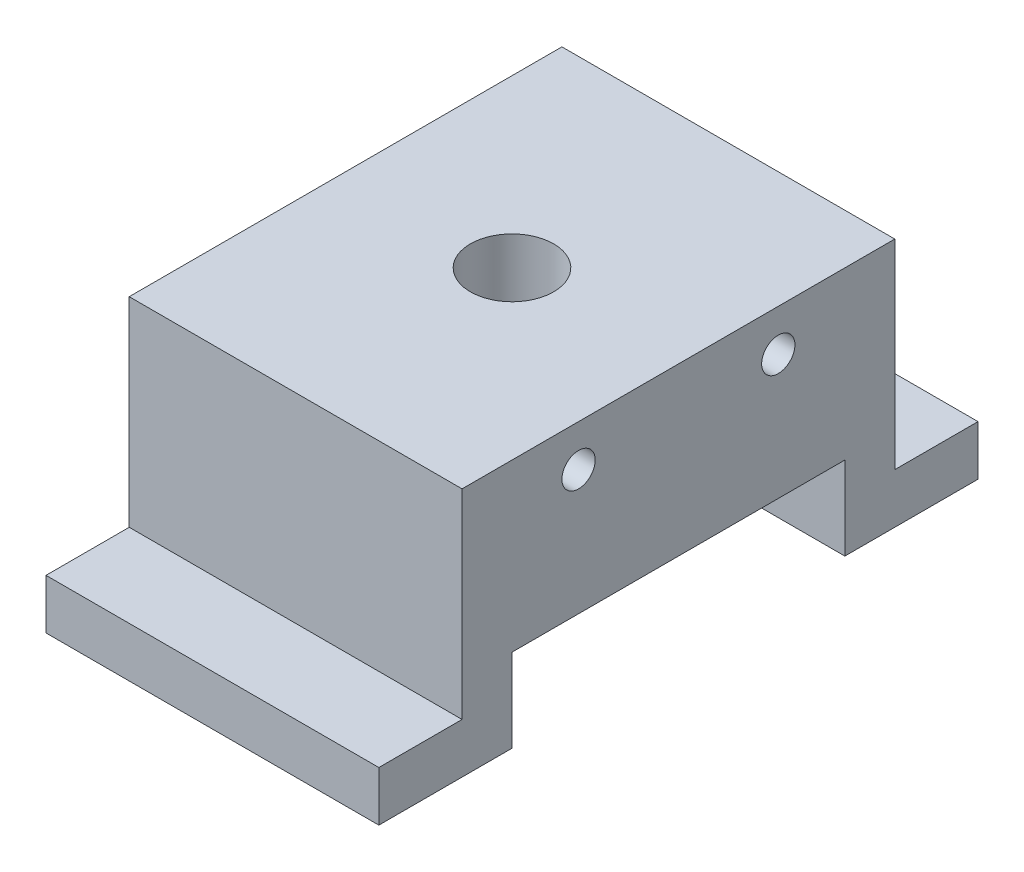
ISO-10303-21;
HEADER;
FILE_DESCRIPTION(('STEP AP214'),'2;1');
FILE_NAME('part.step','',(''),(''),'','','');
FILE_SCHEMA(('AUTOMOTIVE_DESIGN { 1 0 10303 214 1 1 1 1 }'));
ENDSEC;
DATA;
#1=APPLICATION_CONTEXT('core data for automotive mechanical design processes');
#2=APPLICATION_PROTOCOL_DEFINITION('international standard','automotive_design',2000,#1);
#3=PRODUCT_CONTEXT('',#1,'mechanical');
#4=PRODUCT('Part','Part','',(#3));
#5=PRODUCT_RELATED_PRODUCT_CATEGORY('part','',(#4));
#6=PRODUCT_DEFINITION_FORMATION('','',#4);
#7=PRODUCT_DEFINITION_CONTEXT('part definition',#1,'design');
#8=PRODUCT_DEFINITION('design','',#6,#7);
#9=PRODUCT_DEFINITION_SHAPE('','',#8);
#10=(LENGTH_UNIT() NAMED_UNIT(*) SI_UNIT(.MILLI.,.METRE.));
#11=(NAMED_UNIT(*) PLANE_ANGLE_UNIT() SI_UNIT($,.RADIAN.));
#12=(NAMED_UNIT(*) SI_UNIT($,.STERADIAN.) SOLID_ANGLE_UNIT());
#13=UNCERTAINTY_MEASURE_WITH_UNIT(LENGTH_MEASURE(1.E-05),#10,'distance_accuracy_value','');
#14=(GEOMETRIC_REPRESENTATION_CONTEXT(3) GLOBAL_UNCERTAINTY_ASSIGNED_CONTEXT((#13)) GLOBAL_UNIT_ASSIGNED_CONTEXT((#10,
#11,#12)) REPRESENTATION_CONTEXT('',''));
#15=CARTESIAN_POINT('',(0.,0.,0.));
#16=DIRECTION('',(0.,0.,1.));
#17=DIRECTION('',(1.,0.,0.));
#18=AXIS2_PLACEMENT_3D('',#15,#16,#17);
#19=CARTESIAN_POINT('',(10.,0.,0.));
#20=DIRECTION('',(-1.,0.,0.));
#21=DIRECTION('',(0.,0.,1.));
#22=AXIS2_PLACEMENT_3D('',#19,#20,#21);
#23=PLANE('',#22);
#24=DIRECTION('',(0.,1.,0.));
#25=VECTOR('',#24,1.);
#26=CARTESIAN_POINT('',(10.,5.,10.));
#27=LINE('',#26,#25);
#28=CARTESIAN_POINT('',(10.,0.,10.));
#29=VERTEX_POINT('',#28);
#30=CARTESIAN_POINT('',(10.,5.,10.));
#31=VERTEX_POINT('',#30);
#32=EDGE_CURVE('E200',#29,#31,#27,.T.);
#33=ORIENTED_EDGE('',*,*,#32,.T.);
#34=DIRECTION('',(0.,0.,-1.));
#35=VECTOR('',#34,1.);
#36=CARTESIAN_POINT('',(10.,5.,-10.));
#37=LINE('',#36,#35);
#38=CARTESIAN_POINT('',(10.,5.,-10.));
#39=VERTEX_POINT('',#38);
#40=EDGE_CURVE('E112',#31,#39,#37,.T.);
#41=ORIENTED_EDGE('',*,*,#40,.T.);
#42=DIRECTION('',(0.,-1.,0.));
#43=VECTOR('',#42,1.);
#44=CARTESIAN_POINT('',(10.,5.,-10.));
#45=LINE('',#44,#43);
#46=CARTESIAN_POINT('',(10.,0.,-10.));
#47=VERTEX_POINT('',#46);
#48=EDGE_CURVE('E237',#39,#47,#45,.T.);
#49=ORIENTED_EDGE('',*,*,#48,.T.);
#50=DIRECTION('',(0.,0.,-1.));
#51=VECTOR('',#50,1.);
#52=CARTESIAN_POINT('',(10.,0.,-10.));
#53=LINE('',#52,#51);
#54=CARTESIAN_POINT('',(10.,0.,-18.));
#55=VERTEX_POINT('',#54);
#56=EDGE_CURVE('E257',#47,#55,#53,.T.);
#57=ORIENTED_EDGE('',*,*,#56,.T.);
#58=DIRECTION('',(0.,1.,0.));
#59=VECTOR('',#58,1.);
#60=CARTESIAN_POINT('',(10.,0.,-18.));
#61=LINE('',#60,#59);
#62=CARTESIAN_POINT('',(10.,3.,-18.));
#63=VERTEX_POINT('',#62);
#64=EDGE_CURVE('E253',#55,#63,#61,.T.);
#65=ORIENTED_EDGE('',*,*,#64,.T.);
#66=DIRECTION('',(0.,0.,1.));
#67=VECTOR('',#66,1.);
#68=CARTESIAN_POINT('',(10.,3.,-18.));
#69=LINE('',#68,#67);
#70=CARTESIAN_POINT('',(10.,3.,-13.));
#71=VERTEX_POINT('',#70);
#72=EDGE_CURVE('E256',#63,#71,#69,.T.);
#73=ORIENTED_EDGE('',*,*,#72,.T.);
#74=DIRECTION('',(0.,1.,0.));
#75=VECTOR('',#74,1.);
#76=CARTESIAN_POINT('',(10.,3.,-13.));
#77=LINE('',#76,#75);
#78=CARTESIAN_POINT('',(10.,15.,-13.));
#79=VERTEX_POINT('',#78);
#80=EDGE_CURVE('E261',#71,#79,#77,.T.);
#81=ORIENTED_EDGE('',*,*,#80,.T.);
#82=DIRECTION('',(0.,0.,1.));
#83=VECTOR('',#82,1.);
#84=CARTESIAN_POINT('',(10.,15.,13.));
#85=LINE('',#84,#83);
#86=CARTESIAN_POINT('',(10.,15.,13.));
#87=VERTEX_POINT('',#86);
#88=EDGE_CURVE('E268',#79,#87,#85,.T.);
#89=ORIENTED_EDGE('',*,*,#88,.T.);
#90=DIRECTION('',(0.,-1.,0.));
#91=VECTOR('',#90,1.);
#92=CARTESIAN_POINT('',(10.,3.,13.));
#93=LINE('',#92,#91);
#94=CARTESIAN_POINT('',(10.,3.,13.));
#95=VERTEX_POINT('',#94);
#96=EDGE_CURVE('E143',#87,#95,#93,.T.);
#97=ORIENTED_EDGE('',*,*,#96,.T.);
#98=DIRECTION('',(0.,0.,1.));
#99=VECTOR('',#98,1.);
#100=CARTESIAN_POINT('',(10.,3.,18.));
#101=LINE('',#100,#99);
#102=CARTESIAN_POINT('',(10.,3.,18.));
#103=VERTEX_POINT('',#102);
#104=EDGE_CURVE('E137',#95,#103,#101,.T.);
#105=ORIENTED_EDGE('',*,*,#104,.T.);
#106=DIRECTION('',(0.,-1.,0.));
#107=VECTOR('',#106,1.);
#108=CARTESIAN_POINT('',(10.,0.,18.));
#109=LINE('',#108,#107);
#110=CARTESIAN_POINT('',(10.,0.,18.));
#111=VERTEX_POINT('',#110);
#112=EDGE_CURVE('E141',#103,#111,#109,.T.);
#113=ORIENTED_EDGE('',*,*,#112,.T.);
#114=DIRECTION('',(0.,0.,-1.));
#115=VECTOR('',#114,1.);
#116=CARTESIAN_POINT('',(10.,0.,10.));
#117=LINE('',#116,#115);
#118=EDGE_CURVE('E57',#111,#29,#117,.T.);
#119=ORIENTED_EDGE('',*,*,#118,.T.);
#120=EDGE_LOOP('',(#33,#41,#49,#57,#65,#73,#81,#89,#97,#105,#113,#119));
#121=FACE_BOUND('',#120,.T.);
#122=CARTESIAN_POINT('',(10.,12.5,6.));
#123=DIRECTION('',(1.,0.,0.));
#124=DIRECTION('',(0.,0.,-1.));
#125=AXIS2_PLACEMENT_3D('',#122,#123,#124);
#126=CIRCLE('',#125,1.);
#127=CARTESIAN_POINT('',(10.,12.5,5.));
#128=VERTEX_POINT('',#127);
#129=EDGE_CURVE('E170',#128,#128,#126,.T.);
#130=ORIENTED_EDGE('',*,*,#129,.F.);
#131=EDGE_LOOP('',(#130));
#132=FACE_BOUND('',#131,.T.);
#133=CARTESIAN_POINT('',(10.,12.5,-6.));
#134=DIRECTION('',(1.,0.,0.));
#135=DIRECTION('',(0.,0.,-1.));
#136=AXIS2_PLACEMENT_3D('',#133,#134,#135);
#137=CIRCLE('',#136,1.);
#138=CARTESIAN_POINT('',(10.,12.5,-7.));
#139=VERTEX_POINT('',#138);
#140=EDGE_CURVE('E341',#139,#139,#137,.T.);
#141=ORIENTED_EDGE('',*,*,#140,.F.);
#142=EDGE_LOOP('',(#141));
#143=FACE_BOUND('',#142,.T.);
#144=ADVANCED_FACE('F39',(#121,#132,#143),#23,.F.);
#145=CARTESIAN_POINT('',(-10.,0.,0.));
#146=DIRECTION('',(-1.,0.,0.));
#147=DIRECTION('',(0.,0.,1.));
#148=AXIS2_PLACEMENT_3D('',#145,#146,#147);
#149=PLANE('',#148);
#150=CARTESIAN_POINT('',(-10.,12.5,6.));
#151=DIRECTION('',(1.,0.,0.));
#152=DIRECTION('',(0.,0.,-1.));
#153=AXIS2_PLACEMENT_3D('',#150,#151,#152);
#154=CIRCLE('',#153,1.);
#155=CARTESIAN_POINT('',(-10.,12.5,5.));
#156=VERTEX_POINT('',#155);
#157=EDGE_CURVE('E345',#156,#156,#154,.T.);
#158=ORIENTED_EDGE('',*,*,#157,.T.);
#159=EDGE_LOOP('',(#158));
#160=FACE_BOUND('',#159,.T.);
#161=DIRECTION('',(0.,1.,0.));
#162=VECTOR('',#161,1.);
#163=CARTESIAN_POINT('',(-10.,5.,10.));
#164=LINE('',#163,#162);
#165=CARTESIAN_POINT('',(-10.,0.,10.));
#166=VERTEX_POINT('',#165);
#167=CARTESIAN_POINT('',(-10.,5.,10.));
#168=VERTEX_POINT('',#167);
#169=EDGE_CURVE('E165',#166,#168,#164,.T.);
#170=ORIENTED_EDGE('',*,*,#169,.F.);
#171=DIRECTION('',(0.,0.,-1.));
#172=VECTOR('',#171,1.);
#173=CARTESIAN_POINT('',(-10.,0.,10.));
#174=LINE('',#173,#172);
#175=CARTESIAN_POINT('',(-10.,0.,18.));
#176=VERTEX_POINT('',#175);
#177=EDGE_CURVE('E104',#176,#166,#174,.T.);
#178=ORIENTED_EDGE('',*,*,#177,.F.);
#179=DIRECTION('',(0.,-1.,0.));
#180=VECTOR('',#179,1.);
#181=CARTESIAN_POINT('',(-10.,0.,18.));
#182=LINE('',#181,#180);
#183=CARTESIAN_POINT('',(-10.,3.,18.));
#184=VERTEX_POINT('',#183);
#185=EDGE_CURVE('E98',#184,#176,#182,.T.);
#186=ORIENTED_EDGE('',*,*,#185,.F.);
#187=DIRECTION('',(0.,0.,1.));
#188=VECTOR('',#187,1.);
#189=CARTESIAN_POINT('',(-10.,3.,18.));
#190=LINE('',#189,#188);
#191=CARTESIAN_POINT('',(-10.,3.,13.));
#192=VERTEX_POINT('',#191);
#193=EDGE_CURVE('E152',#192,#184,#190,.T.);
#194=ORIENTED_EDGE('',*,*,#193,.F.);
#195=DIRECTION('',(0.,-1.,0.));
#196=VECTOR('',#195,1.);
#197=CARTESIAN_POINT('',(-10.,3.,13.));
#198=LINE('',#197,#196);
#199=CARTESIAN_POINT('',(-10.,15.,13.));
#200=VERTEX_POINT('',#199);
#201=EDGE_CURVE('E191',#200,#192,#198,.T.);
#202=ORIENTED_EDGE('',*,*,#201,.F.);
#203=DIRECTION('',(0.,0.,1.));
#204=VECTOR('',#203,1.);
#205=CARTESIAN_POINT('',(-10.,15.,13.));
#206=LINE('',#205,#204);
#207=CARTESIAN_POINT('',(-10.,15.,-13.));
#208=VERTEX_POINT('',#207);
#209=EDGE_CURVE('E188',#208,#200,#206,.T.);
#210=ORIENTED_EDGE('',*,*,#209,.F.);
#211=DIRECTION('',(0.,1.,0.));
#212=VECTOR('',#211,1.);
#213=CARTESIAN_POINT('',(-10.,3.,-13.));
#214=LINE('',#213,#212);
#215=CARTESIAN_POINT('',(-10.,3.,-13.));
#216=VERTEX_POINT('',#215);
#217=EDGE_CURVE('E185',#216,#208,#214,.T.);
#218=ORIENTED_EDGE('',*,*,#217,.F.);
#219=DIRECTION('',(0.,0.,1.));
#220=VECTOR('',#219,1.);
#221=CARTESIAN_POINT('',(-10.,3.,-18.));
#222=LINE('',#221,#220);
#223=CARTESIAN_POINT('',(-10.,3.,-18.));
#224=VERTEX_POINT('',#223);
#225=EDGE_CURVE('E182',#224,#216,#222,.T.);
#226=ORIENTED_EDGE('',*,*,#225,.F.);
#227=DIRECTION('',(0.,1.,0.));
#228=VECTOR('',#227,1.);
#229=CARTESIAN_POINT('',(-10.,0.,-18.));
#230=LINE('',#229,#228);
#231=CARTESIAN_POINT('',(-10.,0.,-18.));
#232=VERTEX_POINT('',#231);
#233=EDGE_CURVE('E179',#232,#224,#230,.T.);
#234=ORIENTED_EDGE('',*,*,#233,.F.);
#235=DIRECTION('',(0.,0.,-1.));
#236=VECTOR('',#235,1.);
#237=CARTESIAN_POINT('',(-10.,0.,-10.));
#238=LINE('',#237,#236);
#239=CARTESIAN_POINT('',(-10.,0.,-10.));
#240=VERTEX_POINT('',#239);
#241=EDGE_CURVE('E176',#240,#232,#238,.T.);
#242=ORIENTED_EDGE('',*,*,#241,.F.);
#243=DIRECTION('',(0.,-1.,0.));
#244=VECTOR('',#243,1.);
#245=CARTESIAN_POINT('',(-10.,5.,-10.));
#246=LINE('',#245,#244);
#247=CARTESIAN_POINT('',(-10.,5.,-10.));
#248=VERTEX_POINT('',#247);
#249=EDGE_CURVE('E173',#248,#240,#246,.T.);
#250=ORIENTED_EDGE('',*,*,#249,.F.);
#251=DIRECTION('',(0.,0.,-1.));
#252=VECTOR('',#251,1.);
#253=CARTESIAN_POINT('',(-10.,5.,-10.));
#254=LINE('',#253,#252);
#255=EDGE_CURVE('E169',#168,#248,#254,.T.);
#256=ORIENTED_EDGE('',*,*,#255,.F.);
#257=EDGE_LOOP('',(#170,#178,#186,#194,#202,#210,#218,#226,#234,#242,#250,#256));
#258=FACE_BOUND('',#257,.T.);
#259=CARTESIAN_POINT('',(-10.,12.5,-6.));
#260=DIRECTION('',(1.,0.,0.));
#261=DIRECTION('',(0.,0.,-1.));
#262=AXIS2_PLACEMENT_3D('',#259,#260,#261);
#263=CIRCLE('',#262,1.);
#264=CARTESIAN_POINT('',(-10.,12.5,-7.));
#265=VERTEX_POINT('',#264);
#266=EDGE_CURVE('E337',#265,#265,#263,.T.);
#267=ORIENTED_EDGE('',*,*,#266,.T.);
#268=EDGE_LOOP('',(#267));
#269=FACE_BOUND('',#268,.T.);
#270=ADVANCED_FACE('F241',(#160,#258,#269),#149,.T.);
#271=CARTESIAN_POINT('',(10.,5.,10.));
#272=DIRECTION('',(0.,0.,1.));
#273=DIRECTION('',(1.,0.,0.));
#274=AXIS2_PLACEMENT_3D('',#271,#272,#273);
#275=PLANE('',#274);
#276=ORIENTED_EDGE('',*,*,#169,.T.);
#277=DIRECTION('',(-1.,0.,0.));
#278=VECTOR('',#277,1.);
#279=CARTESIAN_POINT('',(10.,5.,10.));
#280=LINE('',#279,#278);
#281=EDGE_CURVE('E11',#31,#168,#280,.T.);
#282=ORIENTED_EDGE('',*,*,#281,.F.);
#283=ORIENTED_EDGE('',*,*,#32,.F.);
#284=DIRECTION('',(-1.,0.,0.));
#285=VECTOR('',#284,1.);
#286=CARTESIAN_POINT('',(10.,0.,10.));
#287=LINE('',#286,#285);
#288=EDGE_CURVE('E161',#29,#166,#287,.T.);
#289=ORIENTED_EDGE('',*,*,#288,.T.);
#290=EDGE_LOOP('',(#276,#282,#283,#289));
#291=FACE_BOUND('',#290,.T.);
#292=ADVANCED_FACE('F41',(#291),#275,.F.);
#293=CARTESIAN_POINT('',(10.,5.,-10.));
#294=DIRECTION('',(0.,1.,0.));
#295=DIRECTION('',(0.,0.,1.));
#296=AXIS2_PLACEMENT_3D('',#293,#294,#295);
#297=PLANE('',#296);
#298=CARTESIAN_POINT('',(0.,5.,0.));
#299=DIRECTION('',(0.,-1.,0.));
#300=DIRECTION('',(0.,0.,-1.));
#301=AXIS2_PLACEMENT_3D('',#298,#299,#300);
#302=CIRCLE('',#301,7.);
#303=CARTESIAN_POINT('',(0.,5.,-7.));
#304=VERTEX_POINT('',#303);
#305=EDGE_CURVE('E330',#304,#304,#302,.T.);
#306=ORIENTED_EDGE('',*,*,#305,.F.);
#307=EDGE_LOOP('',(#306));
#308=FACE_BOUND('',#307,.T.);
#309=ORIENTED_EDGE('',*,*,#255,.T.);
#310=DIRECTION('',(-1.,0.,0.));
#311=VECTOR('',#310,1.);
#312=CARTESIAN_POINT('',(10.,5.,-10.));
#313=LINE('',#312,#311);
#314=EDGE_CURVE('E49',#39,#248,#313,.T.);
#315=ORIENTED_EDGE('',*,*,#314,.F.);
#316=ORIENTED_EDGE('',*,*,#40,.F.);
#317=ORIENTED_EDGE('',*,*,#281,.T.);
#318=EDGE_LOOP('',(#309,#315,#316,#317));
#319=FACE_BOUND('',#318,.T.);
#320=ADVANCED_FACE('F369',(#308,#319),#297,.F.);
#321=CARTESIAN_POINT('',(10.,5.,-10.));
#322=DIRECTION('',(0.,0.,-1.));
#323=DIRECTION('',(-1.,0.,0.));
#324=AXIS2_PLACEMENT_3D('',#321,#322,#323);
#325=PLANE('',#324);
#326=ORIENTED_EDGE('',*,*,#249,.T.);
#327=DIRECTION('',(-1.,0.,0.));
#328=VECTOR('',#327,1.);
#329=CARTESIAN_POINT('',(10.,0.,-10.));
#330=LINE('',#329,#328);
#331=EDGE_CURVE('E227',#47,#240,#330,.T.);
#332=ORIENTED_EDGE('',*,*,#331,.F.);
#333=ORIENTED_EDGE('',*,*,#48,.F.);
#334=ORIENTED_EDGE('',*,*,#314,.T.);
#335=EDGE_LOOP('',(#326,#332,#333,#334));
#336=FACE_BOUND('',#335,.T.);
#337=ADVANCED_FACE('F235',(#336),#325,.F.);
#338=CARTESIAN_POINT('',(10.,0.,-10.));
#339=DIRECTION('',(0.,1.,0.));
#340=DIRECTION('',(0.,0.,1.));
#341=AXIS2_PLACEMENT_3D('',#338,#339,#340);
#342=PLANE('',#341);
#343=ORIENTED_EDGE('',*,*,#241,.T.);
#344=DIRECTION('',(-1.,0.,0.));
#345=VECTOR('',#344,1.);
#346=CARTESIAN_POINT('',(10.,0.,-18.));
#347=LINE('',#346,#345);
#348=EDGE_CURVE('E223',#55,#232,#347,.T.);
#349=ORIENTED_EDGE('',*,*,#348,.F.);
#350=ORIENTED_EDGE('',*,*,#56,.F.);
#351=ORIENTED_EDGE('',*,*,#331,.T.);
#352=EDGE_LOOP('',(#343,#349,#350,#351));
#353=FACE_BOUND('',#352,.T.);
#354=ADVANCED_FACE('F247',(#353),#342,.F.);
#355=CARTESIAN_POINT('',(10.,0.,-18.));
#356=DIRECTION('',(0.,0.,1.));
#357=DIRECTION('',(1.,0.,0.));
#358=AXIS2_PLACEMENT_3D('',#355,#356,#357);
#359=PLANE('',#358);
#360=ORIENTED_EDGE('',*,*,#233,.T.);
#361=DIRECTION('',(-1.,0.,0.));
#362=VECTOR('',#361,1.);
#363=CARTESIAN_POINT('',(10.,3.,-18.));
#364=LINE('',#363,#362);
#365=EDGE_CURVE('E219',#63,#224,#364,.T.);
#366=ORIENTED_EDGE('',*,*,#365,.F.);
#367=ORIENTED_EDGE('',*,*,#64,.F.);
#368=ORIENTED_EDGE('',*,*,#348,.T.);
#369=EDGE_LOOP('',(#360,#366,#367,#368));
#370=FACE_BOUND('',#369,.T.);
#371=ADVANCED_FACE('F251',(#370),#359,.F.);
#372=CARTESIAN_POINT('',(10.,3.,-18.));
#373=DIRECTION('',(0.,-1.,0.));
#374=DIRECTION('',(0.,0.,-1.));
#375=AXIS2_PLACEMENT_3D('',#372,#373,#374);
#376=PLANE('',#375);
#377=ORIENTED_EDGE('',*,*,#225,.T.);
#378=DIRECTION('',(-1.,0.,0.));
#379=VECTOR('',#378,1.);
#380=CARTESIAN_POINT('',(10.,3.,-13.));
#381=LINE('',#380,#379);
#382=EDGE_CURVE('E215',#71,#216,#381,.T.);
#383=ORIENTED_EDGE('',*,*,#382,.F.);
#384=ORIENTED_EDGE('',*,*,#72,.F.);
#385=ORIENTED_EDGE('',*,*,#365,.T.);
#386=EDGE_LOOP('',(#377,#383,#384,#385));
#387=FACE_BOUND('',#386,.T.);
#388=ADVANCED_FACE('F381',(#387),#376,.F.);
#389=CARTESIAN_POINT('',(10.,3.,-13.));
#390=DIRECTION('',(0.,0.,1.));
#391=DIRECTION('',(1.,0.,0.));
#392=AXIS2_PLACEMENT_3D('',#389,#390,#391);
#393=PLANE('',#392);
#394=ORIENTED_EDGE('',*,*,#217,.T.);
#395=DIRECTION('',(-1.,0.,0.));
#396=VECTOR('',#395,1.);
#397=CARTESIAN_POINT('',(10.,15.,-13.));
#398=LINE('',#397,#396);
#399=EDGE_CURVE('E211',#79,#208,#398,.T.);
#400=ORIENTED_EDGE('',*,*,#399,.F.);
#401=ORIENTED_EDGE('',*,*,#80,.F.);
#402=ORIENTED_EDGE('',*,*,#382,.T.);
#403=EDGE_LOOP('',(#394,#400,#401,#402));
#404=FACE_BOUND('',#403,.T.);
#405=ADVANCED_FACE('F384',(#404),#393,.F.);
#406=CARTESIAN_POINT('',(10.,15.,13.));
#407=DIRECTION('',(0.,-1.,0.));
#408=DIRECTION('',(0.,0.,-1.));
#409=AXIS2_PLACEMENT_3D('',#406,#407,#408);
#410=PLANE('',#409);
#411=CARTESIAN_POINT('',(0.,15.,0.));
#412=DIRECTION('',(0.,-1.,0.));
#413=DIRECTION('',(0.,0.,-1.));
#414=AXIS2_PLACEMENT_3D('',#411,#412,#413);
#415=CIRCLE('',#414,2.5);
#416=CARTESIAN_POINT('',(0.,15.,-2.5));
#417=VERTEX_POINT('',#416);
#418=EDGE_CURVE('E323',#417,#417,#415,.T.);
#419=ORIENTED_EDGE('',*,*,#418,.T.);
#420=EDGE_LOOP('',(#419));
#421=FACE_BOUND('',#420,.T.);
#422=ORIENTED_EDGE('',*,*,#209,.T.);
#423=DIRECTION('',(-1.,0.,0.));
#424=VECTOR('',#423,1.);
#425=CARTESIAN_POINT('',(10.,15.,13.));
#426=LINE('',#425,#424);
#427=EDGE_CURVE('E207',#87,#200,#426,.T.);
#428=ORIENTED_EDGE('',*,*,#427,.F.);
#429=ORIENTED_EDGE('',*,*,#88,.F.);
#430=ORIENTED_EDGE('',*,*,#399,.T.);
#431=EDGE_LOOP('',(#422,#428,#429,#430));
#432=FACE_BOUND('',#431,.T.);
#433=ADVANCED_FACE('F276',(#421,#432),#410,.F.);
#434=CARTESIAN_POINT('',(10.,3.,13.));
#435=DIRECTION('',(0.,0.,-1.));
#436=DIRECTION('',(-1.,0.,0.));
#437=AXIS2_PLACEMENT_3D('',#434,#435,#436);
#438=PLANE('',#437);
#439=ORIENTED_EDGE('',*,*,#201,.T.);
#440=DIRECTION('',(-1.,0.,0.));
#441=VECTOR('',#440,1.);
#442=CARTESIAN_POINT('',(10.,3.,13.));
#443=LINE('',#442,#441);
#444=EDGE_CURVE('E154',#95,#192,#443,.T.);
#445=ORIENTED_EDGE('',*,*,#444,.F.);
#446=ORIENTED_EDGE('',*,*,#96,.F.);
#447=ORIENTED_EDGE('',*,*,#427,.T.);
#448=EDGE_LOOP('',(#439,#445,#446,#447));
#449=FACE_BOUND('',#448,.T.);
#450=ADVANCED_FACE('F280',(#449),#438,.F.);
#451=CARTESIAN_POINT('',(10.,3.,18.));
#452=DIRECTION('',(0.,-1.,0.));
#453=DIRECTION('',(0.,0.,-1.));
#454=AXIS2_PLACEMENT_3D('',#451,#452,#453);
#455=PLANE('',#454);
#456=ORIENTED_EDGE('',*,*,#193,.T.);
#457=DIRECTION('',(-1.,0.,0.));
#458=VECTOR('',#457,1.);
#459=CARTESIAN_POINT('',(10.,3.,18.));
#460=LINE('',#459,#458);
#461=EDGE_CURVE('E149',#103,#184,#460,.T.);
#462=ORIENTED_EDGE('',*,*,#461,.F.);
#463=ORIENTED_EDGE('',*,*,#104,.F.);
#464=ORIENTED_EDGE('',*,*,#444,.T.);
#465=EDGE_LOOP('',(#456,#462,#463,#464));
#466=FACE_BOUND('',#465,.T.);
#467=ADVANCED_FACE('F150',(#466),#455,.F.);
#468=CARTESIAN_POINT('',(10.,0.,18.));
#469=DIRECTION('',(0.,0.,-1.));
#470=DIRECTION('',(-1.,0.,0.));
#471=AXIS2_PLACEMENT_3D('',#468,#469,#470);
#472=PLANE('',#471);
#473=ORIENTED_EDGE('',*,*,#185,.T.);
#474=DIRECTION('',(-1.,0.,0.));
#475=VECTOR('',#474,1.);
#476=CARTESIAN_POINT('',(10.,0.,18.));
#477=LINE('',#476,#475);
#478=EDGE_CURVE('E155',#111,#176,#477,.T.);
#479=ORIENTED_EDGE('',*,*,#478,.F.);
#480=ORIENTED_EDGE('',*,*,#112,.F.);
#481=ORIENTED_EDGE('',*,*,#461,.T.);
#482=EDGE_LOOP('',(#473,#479,#480,#481));
#483=FACE_BOUND('',#482,.T.);
#484=ADVANCED_FACE('F157',(#483),#472,.F.);
#485=CARTESIAN_POINT('',(10.,0.,10.));
#486=DIRECTION('',(0.,1.,0.));
#487=DIRECTION('',(0.,0.,1.));
#488=AXIS2_PLACEMENT_3D('',#485,#486,#487);
#489=PLANE('',#488);
#490=ORIENTED_EDGE('',*,*,#177,.T.);
#491=ORIENTED_EDGE('',*,*,#288,.F.);
#492=ORIENTED_EDGE('',*,*,#118,.F.);
#493=ORIENTED_EDGE('',*,*,#478,.T.);
#494=EDGE_LOOP('',(#490,#491,#492,#493));
#495=FACE_BOUND('',#494,.T.);
#496=ADVANCED_FACE('F284',(#495),#489,.F.);
#497=CARTESIAN_POINT('',(10.,12.5,6.));
#498=DIRECTION('',(-1.,0.,0.));
#499=DIRECTION('',(0.,0.,1.));
#500=AXIS2_PLACEMENT_3D('',#497,#498,#499);
#501=CYLINDRICAL_SURFACE('',#500,1.);
#502=ORIENTED_EDGE('',*,*,#129,.T.);
#503=EDGE_LOOP('',(#502));
#504=FACE_BOUND('',#503,.T.);
#505=ORIENTED_EDGE('',*,*,#157,.F.);
#506=EDGE_LOOP('',(#505));
#507=FACE_BOUND('',#506,.T.);
#508=ADVANCED_FACE('F286',(#504,#507),#501,.F.);
#509=CARTESIAN_POINT('',(10.,12.5,-6.));
#510=DIRECTION('',(-1.,0.,0.));
#511=DIRECTION('',(0.,0.,1.));
#512=AXIS2_PLACEMENT_3D('',#509,#510,#511);
#513=CYLINDRICAL_SURFACE('',#512,1.);
#514=ORIENTED_EDGE('',*,*,#140,.T.);
#515=EDGE_LOOP('',(#514));
#516=FACE_BOUND('',#515,.T.);
#517=ORIENTED_EDGE('',*,*,#266,.F.);
#518=EDGE_LOOP('',(#517));
#519=FACE_BOUND('',#518,.T.);
#520=ADVANCED_FACE('F292',(#516,#519),#513,.F.);
#521=CARTESIAN_POINT('',(0.,10.,0.));
#522=DIRECTION('',(0.,-1.,0.));
#523=DIRECTION('',(0.,0.,-1.));
#524=AXIS2_PLACEMENT_3D('',#521,#522,#523);
#525=CYLINDRICAL_SURFACE('',#524,7.);
#526=CARTESIAN_POINT('',(0.,10.,0.));
#527=DIRECTION('',(0.,-1.,0.));
#528=DIRECTION('',(0.,0.,-1.));
#529=AXIS2_PLACEMENT_3D('',#526,#527,#528);
#530=CIRCLE('',#529,7.);
#531=CARTESIAN_POINT('',(0.,10.,-7.));
#532=VERTEX_POINT('',#531);
#533=EDGE_CURVE('E333',#532,#532,#530,.T.);
#534=ORIENTED_EDGE('',*,*,#533,.F.);
#535=EDGE_LOOP('',(#534));
#536=FACE_BOUND('',#535,.T.);
#537=ORIENTED_EDGE('',*,*,#305,.T.);
#538=EDGE_LOOP('',(#537));
#539=FACE_BOUND('',#538,.T.);
#540=ADVANCED_FACE('F306',(#536,#539),#525,.F.);
#541=CARTESIAN_POINT('',(0.,10.,0.));
#542=DIRECTION('',(0.,-1.,0.));
#543=DIRECTION('',(0.,0.,-1.));
#544=AXIS2_PLACEMENT_3D('',#541,#542,#543);
#545=PLANE('',#544);
#546=CARTESIAN_POINT('',(0.,10.,0.));
#547=DIRECTION('',(0.,-1.,0.));
#548=DIRECTION('',(0.,0.,-1.));
#549=AXIS2_PLACEMENT_3D('',#546,#547,#548);
#550=CIRCLE('',#549,2.5);
#551=CARTESIAN_POINT('',(0.,10.,-2.5));
#552=VERTEX_POINT('',#551);
#553=EDGE_CURVE('E326',#552,#552,#550,.T.);
#554=ORIENTED_EDGE('',*,*,#553,.F.);
#555=EDGE_LOOP('',(#554));
#556=FACE_BOUND('',#555,.T.);
#557=ORIENTED_EDGE('',*,*,#533,.T.);
#558=EDGE_LOOP('',(#557));
#559=FACE_BOUND('',#558,.T.);
#560=ADVANCED_FACE('F310',(#556,#559),#545,.T.);
#561=CARTESIAN_POINT('',(0.,15.,0.));
#562=DIRECTION('',(0.,-1.,0.));
#563=DIRECTION('',(0.,0.,-1.));
#564=AXIS2_PLACEMENT_3D('',#561,#562,#563);
#565=CYLINDRICAL_SURFACE('',#564,2.5);
#566=ORIENTED_EDGE('',*,*,#418,.F.);
#567=EDGE_LOOP('',(#566));
#568=FACE_BOUND('',#567,.T.);
#569=ORIENTED_EDGE('',*,*,#553,.T.);
#570=EDGE_LOOP('',(#569));
#571=FACE_BOUND('',#570,.T.);
#572=ADVANCED_FACE('F314',(#568,#571),#565,.F.);
#573=CLOSED_SHELL('',(#144,#270,#292,#320,#337,#354,#371,#388,#405,#433,#450,#467,#484,#496,
#508,#520,#540,#560,#572));
#574=MANIFOLD_SOLID_BREP('B2',#573);
#575=ADVANCED_BREP_SHAPE_REPRESENTATION('',(#18,#574),#14);
#576=SHAPE_DEFINITION_REPRESENTATION(#9,#575);
ENDSEC;
END-ISO-10303-21;
